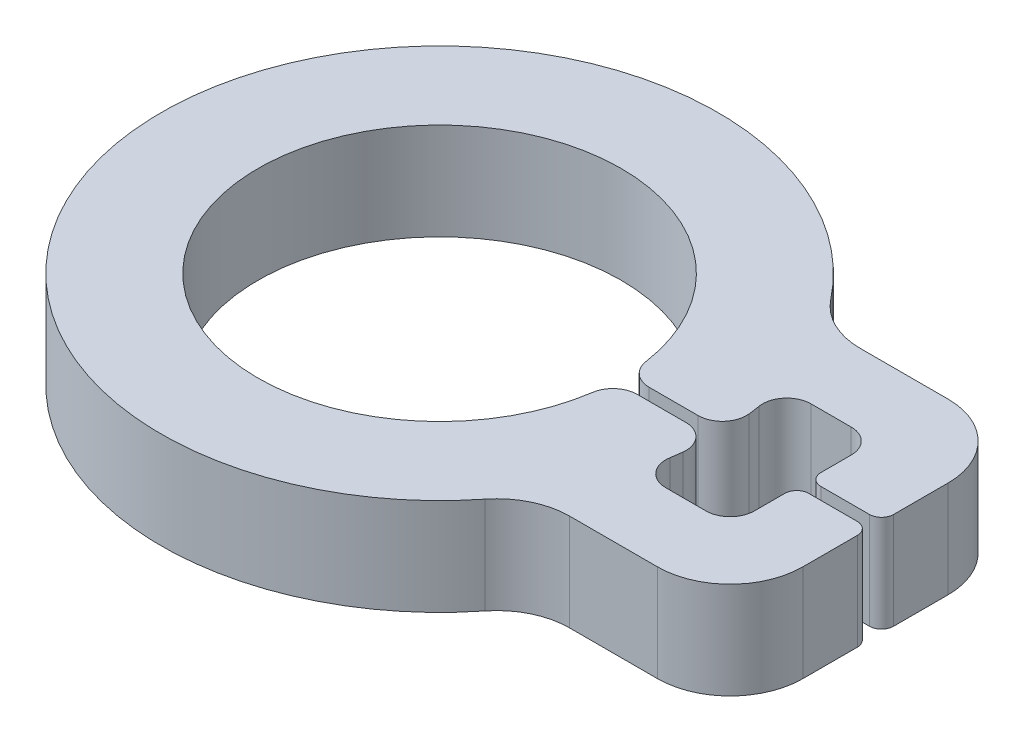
ISO-10303-21;
HEADER;
FILE_DESCRIPTION(('STEP AP214'),'2;1');
FILE_NAME('part.step','',(''),(''),'','','');
FILE_SCHEMA(('AUTOMOTIVE_DESIGN { 1 0 10303 214 1 1 1 1 }'));
ENDSEC;
DATA;
#1=APPLICATION_CONTEXT('core data for automotive mechanical design processes');
#2=APPLICATION_PROTOCOL_DEFINITION('international standard','automotive_design',2000,#1);
#3=PRODUCT_CONTEXT('',#1,'mechanical');
#4=PRODUCT('Part','Part','',(#3));
#5=PRODUCT_RELATED_PRODUCT_CATEGORY('part','',(#4));
#6=PRODUCT_DEFINITION_FORMATION('','',#4);
#7=PRODUCT_DEFINITION_CONTEXT('part definition',#1,'design');
#8=PRODUCT_DEFINITION('design','',#6,#7);
#9=PRODUCT_DEFINITION_SHAPE('','',#8);
#10=(LENGTH_UNIT() NAMED_UNIT(*) SI_UNIT(.MILLI.,.METRE.));
#11=(NAMED_UNIT(*) PLANE_ANGLE_UNIT() SI_UNIT($,.RADIAN.));
#12=(NAMED_UNIT(*) SI_UNIT($,.STERADIAN.) SOLID_ANGLE_UNIT());
#13=UNCERTAINTY_MEASURE_WITH_UNIT(LENGTH_MEASURE(1.E-05),#10,'distance_accuracy_value','');
#14=(GEOMETRIC_REPRESENTATION_CONTEXT(3) GLOBAL_UNCERTAINTY_ASSIGNED_CONTEXT((#13)) GLOBAL_UNIT_ASSIGNED_CONTEXT((#10,
#11,#12)) REPRESENTATION_CONTEXT('',''));
#15=CARTESIAN_POINT('',(0.,0.,0.));
#16=DIRECTION('',(0.,0.,1.));
#17=DIRECTION('',(1.,0.,0.));
#18=AXIS2_PLACEMENT_3D('',#15,#16,#17);
#19=CARTESIAN_POINT('',(0.,4.,0.));
#20=DIRECTION('',(0.,-1.,0.));
#21=DIRECTION('',(0.,0.,-1.));
#22=AXIS2_PLACEMENT_3D('',#19,#20,#21);
#23=CYLINDRICAL_SURFACE('',#22,11.5);
#24=CARTESIAN_POINT('',(0.,0.,0.));
#25=DIRECTION('',(0.,1.,0.));
#26=DIRECTION('',(0.,0.,1.));
#27=AXIS2_PLACEMENT_3D('',#24,#25,#26);
#28=CIRCLE('',#27,11.5);
#29=CARTESIAN_POINT('',(9.01664796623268,0.,-7.13793103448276));
#30=VERTEX_POINT('',#29);
#31=CARTESIAN_POINT('',(9.01664796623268,0.,7.13793103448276));
#32=VERTEX_POINT('',#31);
#33=EDGE_CURVE('E435',#30,#32,#28,.T.);
#34=ORIENTED_EDGE('',*,*,#33,.T.);
#35=DIRECTION('',(0.,-1.,0.));
#36=VECTOR('',#35,1.);
#37=CARTESIAN_POINT('',(9.01664796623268,4.,7.13793103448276));
#38=LINE('',#37,#36);
#39=CARTESIAN_POINT('',(9.01664796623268,4.,7.13793103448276));
#40=VERTEX_POINT('',#39);
#41=EDGE_CURVE('E412',#32,#40,#38,.F.);
#42=ORIENTED_EDGE('',*,*,#41,.T.);
#43=CARTESIAN_POINT('',(0.,4.,0.));
#44=DIRECTION('',(0.,1.,0.));
#45=DIRECTION('',(0.,0.,1.));
#46=AXIS2_PLACEMENT_3D('',#43,#44,#45);
#47=CIRCLE('',#46,11.5);
#48=CARTESIAN_POINT('',(9.01664796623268,4.,-7.13793103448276));
#49=VERTEX_POINT('',#48);
#50=EDGE_CURVE('E298',#49,#40,#47,.T.);
#51=ORIENTED_EDGE('',*,*,#50,.F.);
#52=DIRECTION('',(0.,-1.,0.));
#53=VECTOR('',#52,1.);
#54=CARTESIAN_POINT('',(9.01664796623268,4.,-7.13793103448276));
#55=LINE('',#54,#53);
#56=EDGE_CURVE('E409',#49,#30,#55,.T.);
#57=ORIENTED_EDGE('',*,*,#56,.T.);
#58=EDGE_LOOP('',(#34,#42,#51,#57));
#59=FACE_BOUND('',#58,.T.);
#60=ADVANCED_FACE('F36',(#59),#23,.T.);
#61=CARTESIAN_POINT('',(9.81070843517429,4.,6.));
#62=DIRECTION('',(0.,0.,-1.));
#63=DIRECTION('',(-1.,0.,0.));
#64=AXIS2_PLACEMENT_3D('',#61,#62,#63);
#65=PLANE('',#64);
#66=DIRECTION('',(1.,0.,0.));
#67=VECTOR('',#66,1.);
#68=CARTESIAN_POINT('',(9.81070843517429,4.,6.));
#69=LINE('',#68,#67);
#70=CARTESIAN_POINT('',(11.3688170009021,4.,6.));
#71=VERTEX_POINT('',#70);
#72=CARTESIAN_POINT('',(15.,4.,6.));
#73=VERTEX_POINT('',#72);
#74=EDGE_CURVE('E455',#71,#73,#69,.T.);
#75=ORIENTED_EDGE('',*,*,#74,.F.);
#76=DIRECTION('',(0.,1.,0.));
#77=VECTOR('',#76,1.);
#78=CARTESIAN_POINT('',(11.3688170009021,0.,6.));
#79=LINE('',#78,#77);
#80=CARTESIAN_POINT('',(11.3688170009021,0.,6.));
#81=VERTEX_POINT('',#80);
#82=EDGE_CURVE('E406',#71,#81,#79,.F.);
#83=ORIENTED_EDGE('',*,*,#82,.T.);
#84=DIRECTION('',(1.,0.,0.));
#85=VECTOR('',#84,1.);
#86=CARTESIAN_POINT('',(9.81070843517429,0.,6.));
#87=LINE('',#86,#85);
#88=CARTESIAN_POINT('',(15.,0.,6.));
#89=VERTEX_POINT('',#88);
#90=EDGE_CURVE('E494',#81,#89,#87,.T.);
#91=ORIENTED_EDGE('',*,*,#90,.T.);
#92=DIRECTION('',(0.,-1.,0.));
#93=VECTOR('',#92,1.);
#94=CARTESIAN_POINT('',(15.,4.,6.));
#95=LINE('',#94,#93);
#96=EDGE_CURVE('E404',#89,#73,#95,.F.);
#97=ORIENTED_EDGE('',*,*,#96,.T.);
#98=EDGE_LOOP('',(#75,#83,#91,#97));
#99=FACE_BOUND('',#98,.T.);
#100=ADVANCED_FACE('F530',(#99),#65,.F.);
#101=CARTESIAN_POINT('',(18.,4.,6.));
#102=DIRECTION('',(-1.,0.,0.));
#103=DIRECTION('',(0.,0.,1.));
#104=AXIS2_PLACEMENT_3D('',#101,#102,#103);
#105=PLANE('',#104);
#106=DIRECTION('',(0.,0.,-1.));
#107=VECTOR('',#106,1.);
#108=CARTESIAN_POINT('',(18.,4.,6.));
#109=LINE('',#108,#107);
#110=CARTESIAN_POINT('',(18.,4.,3.));
#111=VERTEX_POINT('',#110);
#112=CARTESIAN_POINT('',(18.,4.,0.75));
#113=VERTEX_POINT('',#112);
#114=EDGE_CURVE('E457',#111,#113,#109,.T.);
#115=ORIENTED_EDGE('',*,*,#114,.F.);
#116=DIRECTION('',(0.,-1.,0.));
#117=VECTOR('',#116,1.);
#118=CARTESIAN_POINT('',(18.,4.,3.));
#119=LINE('',#118,#117);
#120=CARTESIAN_POINT('',(18.,0.,3.));
#121=VERTEX_POINT('',#120);
#122=EDGE_CURVE('E419',#111,#121,#119,.T.);
#123=ORIENTED_EDGE('',*,*,#122,.T.);
#124=DIRECTION('',(0.,0.,-1.));
#125=VECTOR('',#124,1.);
#126=CARTESIAN_POINT('',(18.,0.,6.));
#127=LINE('',#126,#125);
#128=CARTESIAN_POINT('',(18.,0.,0.75));
#129=VERTEX_POINT('',#128);
#130=EDGE_CURVE('E497',#121,#129,#127,.T.);
#131=ORIENTED_EDGE('',*,*,#130,.T.);
#132=DIRECTION('',(0.,-1.,0.));
#133=VECTOR('',#132,1.);
#134=CARTESIAN_POINT('',(18.,4.,0.75));
#135=LINE('',#134,#133);
#136=EDGE_CURVE('E380',#129,#113,#135,.F.);
#137=ORIENTED_EDGE('',*,*,#136,.T.);
#138=EDGE_LOOP('',(#115,#123,#131,#137));
#139=FACE_BOUND('',#138,.T.);
#140=ADVANCED_FACE('F535',(#139),#105,.F.);
#141=CARTESIAN_POINT('',(18.,4.,0.25));
#142=DIRECTION('',(0.,0.,1.));
#143=DIRECTION('',(1.,0.,0.));
#144=AXIS2_PLACEMENT_3D('',#141,#142,#143);
#145=PLANE('',#144);
#146=DIRECTION('',(-1.,0.,0.));
#147=VECTOR('',#146,1.);
#148=CARTESIAN_POINT('',(18.,4.,0.25));
#149=LINE('',#148,#147);
#150=CARTESIAN_POINT('',(17.5,4.,0.25));
#151=VERTEX_POINT('',#150);
#152=CARTESIAN_POINT('',(15.5,4.,0.25));
#153=VERTEX_POINT('',#152);
#154=EDGE_CURVE('E461',#151,#153,#149,.T.);
#155=ORIENTED_EDGE('',*,*,#154,.F.);
#156=DIRECTION('',(0.,-1.,0.));
#157=VECTOR('',#156,1.);
#158=CARTESIAN_POINT('',(17.5,4.,0.25));
#159=LINE('',#158,#157);
#160=CARTESIAN_POINT('',(17.5,0.,0.25));
#161=VERTEX_POINT('',#160);
#162=EDGE_CURVE('E368',#151,#161,#159,.T.);
#163=ORIENTED_EDGE('',*,*,#162,.T.);
#164=DIRECTION('',(-1.,0.,0.));
#165=VECTOR('',#164,1.);
#166=CARTESIAN_POINT('',(18.,0.,0.25));
#167=LINE('',#166,#165);
#168=CARTESIAN_POINT('',(15.5,0.,0.25));
#169=VERTEX_POINT('',#168);
#170=EDGE_CURVE('E499',#161,#169,#167,.T.);
#171=ORIENTED_EDGE('',*,*,#170,.T.);
#172=DIRECTION('',(0.,-1.,0.));
#173=VECTOR('',#172,1.);
#174=CARTESIAN_POINT('',(15.5,4.,0.25));
#175=LINE('',#174,#173);
#176=EDGE_CURVE('E366',#169,#153,#175,.F.);
#177=ORIENTED_EDGE('',*,*,#176,.T.);
#178=EDGE_LOOP('',(#155,#163,#171,#177));
#179=FACE_BOUND('',#178,.T.);
#180=ADVANCED_FACE('F608',(#179),#145,.F.);
#181=CARTESIAN_POINT('',(15.,4.,0.25));
#182=DIRECTION('',(1.,0.,0.));
#183=DIRECTION('',(0.,0.,-1.));
#184=AXIS2_PLACEMENT_3D('',#181,#182,#183);
#185=PLANE('',#184);
#186=DIRECTION('',(0.,0.,1.));
#187=VECTOR('',#186,1.);
#188=CARTESIAN_POINT('',(15.,4.,0.25));
#189=LINE('',#188,#187);
#190=CARTESIAN_POINT('',(15.,4.,0.75));
#191=VERTEX_POINT('',#190);
#192=CARTESIAN_POINT('',(15.,4.,2.));
#193=VERTEX_POINT('',#192);
#194=EDGE_CURVE('E464',#191,#193,#189,.T.);
#195=ORIENTED_EDGE('',*,*,#194,.F.);
#196=DIRECTION('',(0.,-1.,0.));
#197=VECTOR('',#196,1.);
#198=CARTESIAN_POINT('',(15.,4.,0.75));
#199=LINE('',#198,#197);
#200=CARTESIAN_POINT('',(15.,0.,0.75));
#201=VERTEX_POINT('',#200);
#202=EDGE_CURVE('E399',#191,#201,#199,.T.);
#203=ORIENTED_EDGE('',*,*,#202,.T.);
#204=DIRECTION('',(0.,0.,1.));
#205=VECTOR('',#204,1.);
#206=CARTESIAN_POINT('',(15.,0.,0.25));
#207=LINE('',#206,#205);
#208=CARTESIAN_POINT('',(15.,0.,2.));
#209=VERTEX_POINT('',#208);
#210=EDGE_CURVE('E502',#201,#209,#207,.T.);
#211=ORIENTED_EDGE('',*,*,#210,.T.);
#212=DIRECTION('',(0.,-1.,0.));
#213=VECTOR('',#212,1.);
#214=CARTESIAN_POINT('',(15.,4.,2.));
#215=LINE('',#214,#213);
#216=EDGE_CURVE('E336',#209,#193,#215,.F.);
#217=ORIENTED_EDGE('',*,*,#216,.T.);
#218=EDGE_LOOP('',(#195,#203,#211,#217));
#219=FACE_BOUND('',#218,.T.);
#220=ADVANCED_FACE('F614',(#219),#185,.F.);
#221=CARTESIAN_POINT('',(15.,4.,3.));
#222=DIRECTION('',(0.,0.,1.));
#223=DIRECTION('',(1.,0.,0.));
#224=AXIS2_PLACEMENT_3D('',#221,#222,#223);
#225=PLANE('',#224);
#226=DIRECTION('',(-1.,0.,0.));
#227=VECTOR('',#226,1.);
#228=CARTESIAN_POINT('',(15.,0.,3.));
#229=LINE('',#228,#227);
#230=CARTESIAN_POINT('',(14.,0.,3.));
#231=VERTEX_POINT('',#230);
#232=CARTESIAN_POINT('',(12.3389626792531,0.,3.));
#233=VERTEX_POINT('',#232);
#234=EDGE_CURVE('E504',#231,#233,#229,.T.);
#235=ORIENTED_EDGE('',*,*,#234,.T.);
#236=DIRECTION('',(0.,1.,0.));
#237=VECTOR('',#236,1.);
#238=CARTESIAN_POINT('',(12.3389626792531,4.,3.));
#239=LINE('',#238,#237);
#240=CARTESIAN_POINT('',(12.3389626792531,4.,3.));
#241=VERTEX_POINT('',#240);
#242=EDGE_CURVE('E334',#233,#241,#239,.T.);
#243=ORIENTED_EDGE('',*,*,#242,.T.);
#244=DIRECTION('',(-1.,0.,0.));
#245=VECTOR('',#244,1.);
#246=CARTESIAN_POINT('',(15.,4.,3.));
#247=LINE('',#246,#245);
#248=CARTESIAN_POINT('',(14.,4.,3.));
#249=VERTEX_POINT('',#248);
#250=EDGE_CURVE('E466',#249,#241,#247,.T.);
#251=ORIENTED_EDGE('',*,*,#250,.F.);
#252=DIRECTION('',(0.,-1.,0.));
#253=VECTOR('',#252,1.);
#254=CARTESIAN_POINT('',(14.,0.,3.));
#255=LINE('',#254,#253);
#256=EDGE_CURVE('E331',#249,#231,#255,.T.);
#257=ORIENTED_EDGE('',*,*,#256,.T.);
#258=EDGE_LOOP('',(#235,#243,#251,#257));
#259=FACE_BOUND('',#258,.T.);
#260=ADVANCED_FACE('F527',(#259),#225,.F.);
#261=CARTESIAN_POINT('',(0.,4.,0.));
#262=DIRECTION('',(0.,-1.,0.));
#263=DIRECTION('',(0.,0.,-1.));
#264=AXIS2_PLACEMENT_3D('',#261,#262,#263);
#265=CYLINDRICAL_SURFACE('',#264,11.5);
#266=CARTESIAN_POINT('',(0.,4.,0.));
#267=DIRECTION('',(0.,1.,0.));
#268=DIRECTION('',(0.,0.,1.));
#269=AXIS2_PLACEMENT_3D('',#266,#267,#268);
#270=CIRCLE('',#269,11.5);
#271=CARTESIAN_POINT('',(11.3518456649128,4.,1.84));
#272=VERTEX_POINT('',#271);
#273=CARTESIAN_POINT('',(11.4182182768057,4.,1.36904761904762));
#274=VERTEX_POINT('',#273);
#275=EDGE_CURVE('E469',#272,#274,#270,.T.);
#276=ORIENTED_EDGE('',*,*,#275,.F.);
#277=DIRECTION('',(0.,-1.,0.));
#278=VECTOR('',#277,1.);
#279=CARTESIAN_POINT('',(11.3518456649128,4.,1.84));
#280=LINE('',#279,#278);
#281=CARTESIAN_POINT('',(11.3518456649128,0.,1.84));
#282=VERTEX_POINT('',#281);
#283=EDGE_CURVE('E328',#272,#282,#280,.T.);
#284=ORIENTED_EDGE('',*,*,#283,.T.);
#285=CARTESIAN_POINT('',(0.,0.,0.));
#286=DIRECTION('',(0.,1.,0.));
#287=DIRECTION('',(0.,0.,1.));
#288=AXIS2_PLACEMENT_3D('',#285,#286,#287);
#289=CIRCLE('',#288,11.5);
#290=CARTESIAN_POINT('',(11.4182182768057,0.,1.36904761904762));
#291=VERTEX_POINT('',#290);
#292=EDGE_CURVE('E278',#282,#291,#289,.T.);
#293=ORIENTED_EDGE('',*,*,#292,.T.);
#294=DIRECTION('',(0.,-1.,0.));
#295=VECTOR('',#294,1.);
#296=CARTESIAN_POINT('',(11.4182182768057,4.,1.36904761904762));
#297=LINE('',#296,#295);
#298=EDGE_CURVE('E322',#291,#274,#297,.F.);
#299=ORIENTED_EDGE('',*,*,#298,.T.);
#300=EDGE_LOOP('',(#276,#284,#293,#299));
#301=FACE_BOUND('',#300,.T.);
#302=ADVANCED_FACE('F509',(#301),#265,.T.);
#303=CARTESIAN_POINT('',(7.49583217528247,4.,0.25));
#304=DIRECTION('',(0.,0.,1.));
#305=DIRECTION('',(1.,0.,0.));
#306=AXIS2_PLACEMENT_3D('',#303,#304,#305);
#307=PLANE('',#306);
#308=DIRECTION('',(-1.,0.,0.));
#309=VECTOR('',#308,1.);
#310=CARTESIAN_POINT('',(7.49583217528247,0.,0.25));
#311=LINE('',#310,#309);
#312=CARTESIAN_POINT('',(10.4253297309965,0.,0.25));
#313=VERTEX_POINT('',#312);
#314=CARTESIAN_POINT('',(8.40758586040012,0.,0.25));
#315=VERTEX_POINT('',#314);
#316=EDGE_CURVE('E273',#313,#315,#311,.T.);
#317=ORIENTED_EDGE('',*,*,#316,.T.);
#318=DIRECTION('',(0.,-1.,0.));
#319=VECTOR('',#318,1.);
#320=CARTESIAN_POINT('',(8.40758586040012,4.,0.25));
#321=LINE('',#320,#319);
#322=CARTESIAN_POINT('',(8.40758586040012,4.,0.25));
#323=VERTEX_POINT('',#322);
#324=EDGE_CURVE('E251',#315,#323,#321,.F.);
#325=ORIENTED_EDGE('',*,*,#324,.T.);
#326=DIRECTION('',(-1.,0.,0.));
#327=VECTOR('',#326,1.);
#328=CARTESIAN_POINT('',(7.49583217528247,4.,0.25));
#329=LINE('',#328,#327);
#330=CARTESIAN_POINT('',(10.4253297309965,4.,0.25));
#331=VERTEX_POINT('',#330);
#332=EDGE_CURVE('E471',#331,#323,#329,.T.);
#333=ORIENTED_EDGE('',*,*,#332,.F.);
#334=DIRECTION('',(0.,-1.,0.));
#335=VECTOR('',#334,1.);
#336=CARTESIAN_POINT('',(10.4253297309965,4.,0.25));
#337=LINE('',#336,#335);
#338=EDGE_CURVE('E255',#331,#313,#337,.T.);
#339=ORIENTED_EDGE('',*,*,#338,.T.);
#340=EDGE_LOOP('',(#317,#325,#333,#339));
#341=FACE_BOUND('',#340,.T.);
#342=ADVANCED_FACE('F518',(#341),#307,.F.);
#343=CARTESIAN_POINT('',(0.,4.,0.));
#344=DIRECTION('',(0.,-1.,0.));
#345=DIRECTION('',(0.,0.,-1.));
#346=AXIS2_PLACEMENT_3D('',#343,#344,#345);
#347=CYLINDRICAL_SURFACE('',#346,7.5);
#348=CARTESIAN_POINT('',(0.,4.,0.));
#349=DIRECTION('',(0.,-1.,0.));
#350=DIRECTION('',(0.,0.,1.));
#351=AXIS2_PLACEMENT_3D('',#348,#349,#350);
#352=CIRCLE('',#351,7.5);
#353=CARTESIAN_POINT('',(7.41845811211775,4.,1.10294117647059));
#354=VERTEX_POINT('',#353);
#355=CARTESIAN_POINT('',(7.41845811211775,4.,-1.10294117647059));
#356=VERTEX_POINT('',#355);
#357=EDGE_CURVE('E265',#354,#356,#352,.T.);
#358=ORIENTED_EDGE('',*,*,#357,.F.);
#359=DIRECTION('',(0.,-1.,0.));
#360=VECTOR('',#359,1.);
#361=CARTESIAN_POINT('',(7.41845811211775,4.,1.10294117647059));
#362=LINE('',#361,#360);
#363=CARTESIAN_POINT('',(7.41845811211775,0.,1.10294117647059));
#364=VERTEX_POINT('',#363);
#365=EDGE_CURVE('E250',#354,#364,#362,.T.);
#366=ORIENTED_EDGE('',*,*,#365,.T.);
#367=CARTESIAN_POINT('',(0.,0.,0.));
#368=DIRECTION('',(0.,-1.,0.));
#369=DIRECTION('',(0.,0.,1.));
#370=AXIS2_PLACEMENT_3D('',#367,#368,#369);
#371=CIRCLE('',#370,7.5);
#372=CARTESIAN_POINT('',(7.41845811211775,0.,-1.10294117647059));
#373=VERTEX_POINT('',#372);
#374=EDGE_CURVE('E262',#364,#373,#371,.T.);
#375=ORIENTED_EDGE('',*,*,#374,.T.);
#376=DIRECTION('',(0.,-1.,0.));
#377=VECTOR('',#376,1.);
#378=CARTESIAN_POINT('',(7.41845811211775,4.,-1.10294117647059));
#379=LINE('',#378,#377);
#380=EDGE_CURVE('E267',#373,#356,#379,.F.);
#381=ORIENTED_EDGE('',*,*,#380,.T.);
#382=EDGE_LOOP('',(#358,#366,#375,#381));
#383=FACE_BOUND('',#382,.T.);
#384=ADVANCED_FACE('F261',(#383),#347,.F.);
#385=CARTESIAN_POINT('',(7.49583217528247,4.,-0.25));
#386=DIRECTION('',(0.,0.,-1.));
#387=DIRECTION('',(-1.,0.,0.));
#388=AXIS2_PLACEMENT_3D('',#385,#386,#387);
#389=PLANE('',#388);
#390=DIRECTION('',(1.,0.,0.));
#391=VECTOR('',#390,1.);
#392=CARTESIAN_POINT('',(7.49583217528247,4.,-0.25));
#393=LINE('',#392,#391);
#394=CARTESIAN_POINT('',(8.40758586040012,4.,-0.25));
#395=VERTEX_POINT('',#394);
#396=CARTESIAN_POINT('',(10.4253297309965,4.,-0.25));
#397=VERTEX_POINT('',#396);
#398=EDGE_CURVE('E475',#395,#397,#393,.T.);
#399=ORIENTED_EDGE('',*,*,#398,.F.);
#400=DIRECTION('',(0.,-1.,0.));
#401=VECTOR('',#400,1.);
#402=CARTESIAN_POINT('',(8.40758586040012,4.,-0.25));
#403=LINE('',#402,#401);
#404=CARTESIAN_POINT('',(8.40758586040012,0.,-0.25));
#405=VERTEX_POINT('',#404);
#406=EDGE_CURVE('E319',#395,#405,#403,.T.);
#407=ORIENTED_EDGE('',*,*,#406,.T.);
#408=DIRECTION('',(1.,0.,0.));
#409=VECTOR('',#408,1.);
#410=CARTESIAN_POINT('',(7.49583217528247,0.,-0.25));
#411=LINE('',#410,#409);
#412=CARTESIAN_POINT('',(10.4253297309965,0.,-0.25));
#413=VERTEX_POINT('',#412);
#414=EDGE_CURVE('E272',#405,#413,#411,.T.);
#415=ORIENTED_EDGE('',*,*,#414,.T.);
#416=DIRECTION('',(0.,-1.,0.));
#417=VECTOR('',#416,1.);
#418=CARTESIAN_POINT('',(10.4253297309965,4.,-0.25));
#419=LINE('',#418,#417);
#420=EDGE_CURVE('E317',#413,#397,#419,.F.);
#421=ORIENTED_EDGE('',*,*,#420,.T.);
#422=EDGE_LOOP('',(#399,#407,#415,#421));
#423=FACE_BOUND('',#422,.T.);
#424=ADVANCED_FACE('F525',(#423),#389,.F.);
#425=CARTESIAN_POINT('',(0.,4.,0.));
#426=DIRECTION('',(0.,-1.,0.));
#427=DIRECTION('',(0.,0.,-1.));
#428=AXIS2_PLACEMENT_3D('',#425,#426,#427);
#429=CYLINDRICAL_SURFACE('',#428,11.5);
#430=CARTESIAN_POINT('',(0.,0.,0.));
#431=DIRECTION('',(0.,1.,0.));
#432=DIRECTION('',(0.,0.,1.));
#433=AXIS2_PLACEMENT_3D('',#430,#431,#432);
#434=CIRCLE('',#433,11.5);
#435=CARTESIAN_POINT('',(11.4182182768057,0.,-1.36904761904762));
#436=VERTEX_POINT('',#435);
#437=CARTESIAN_POINT('',(11.3518456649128,0.,-1.84));
#438=VERTEX_POINT('',#437);
#439=EDGE_CURVE('E276',#436,#438,#434,.T.);
#440=ORIENTED_EDGE('',*,*,#439,.T.);
#441=DIRECTION('',(0.,-1.,0.));
#442=VECTOR('',#441,1.);
#443=CARTESIAN_POINT('',(11.3518456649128,4.,-1.84));
#444=LINE('',#443,#442);
#445=CARTESIAN_POINT('',(11.3518456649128,4.,-1.84));
#446=VERTEX_POINT('',#445);
#447=EDGE_CURVE('E347',#438,#446,#444,.F.);
#448=ORIENTED_EDGE('',*,*,#447,.T.);
#449=CARTESIAN_POINT('',(0.,4.,0.));
#450=DIRECTION('',(0.,1.,0.));
#451=DIRECTION('',(0.,0.,1.));
#452=AXIS2_PLACEMENT_3D('',#449,#450,#451);
#453=CIRCLE('',#452,11.5);
#454=CARTESIAN_POINT('',(11.4182182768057,4.,-1.36904761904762));
#455=VERTEX_POINT('',#454);
#456=EDGE_CURVE('E478',#455,#446,#453,.T.);
#457=ORIENTED_EDGE('',*,*,#456,.F.);
#458=DIRECTION('',(0.,-1.,0.));
#459=VECTOR('',#458,1.);
#460=CARTESIAN_POINT('',(11.4182182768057,4.,-1.36904761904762));
#461=LINE('',#460,#459);
#462=EDGE_CURVE('E325',#455,#436,#461,.T.);
#463=ORIENTED_EDGE('',*,*,#462,.T.);
#464=EDGE_LOOP('',(#440,#448,#457,#463));
#465=FACE_BOUND('',#464,.T.);
#466=ADVANCED_FACE('F806',(#465),#429,.T.);
#467=CARTESIAN_POINT('',(15.,4.,-3.));
#468=DIRECTION('',(0.,0.,-1.));
#469=DIRECTION('',(-1.,0.,0.));
#470=AXIS2_PLACEMENT_3D('',#467,#468,#469);
#471=PLANE('',#470);
#472=DIRECTION('',(1.,0.,0.));
#473=VECTOR('',#472,1.);
#474=CARTESIAN_POINT('',(15.,0.,-3.));
#475=LINE('',#474,#473);
#476=CARTESIAN_POINT('',(12.3389626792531,0.,-3.));
#477=VERTEX_POINT('',#476);
#478=CARTESIAN_POINT('',(14.,0.,-3.));
#479=VERTEX_POINT('',#478);
#480=EDGE_CURVE('E284',#477,#479,#475,.T.);
#481=ORIENTED_EDGE('',*,*,#480,.T.);
#482=DIRECTION('',(0.,-1.,0.));
#483=VECTOR('',#482,1.);
#484=CARTESIAN_POINT('',(14.,4.,-3.));
#485=LINE('',#484,#483);
#486=CARTESIAN_POINT('',(14.,4.,-3.));
#487=VERTEX_POINT('',#486);
#488=EDGE_CURVE('E345',#479,#487,#485,.F.);
#489=ORIENTED_EDGE('',*,*,#488,.T.);
#490=DIRECTION('',(1.,0.,0.));
#491=VECTOR('',#490,1.);
#492=CARTESIAN_POINT('',(15.,4.,-3.));
#493=LINE('',#492,#491);
#494=CARTESIAN_POINT('',(12.3389626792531,4.,-3.));
#495=VERTEX_POINT('',#494);
#496=EDGE_CURVE('E481',#495,#487,#493,.T.);
#497=ORIENTED_EDGE('',*,*,#496,.F.);
#498=DIRECTION('',(0.,1.,0.));
#499=VECTOR('',#498,1.);
#500=CARTESIAN_POINT('',(12.3389626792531,0.,-3.));
#501=LINE('',#500,#499);
#502=EDGE_CURVE('E342',#495,#477,#501,.F.);
#503=ORIENTED_EDGE('',*,*,#502,.T.);
#504=EDGE_LOOP('',(#481,#489,#497,#503));
#505=FACE_BOUND('',#504,.T.);
#506=ADVANCED_FACE('F661',(#505),#471,.F.);
#507=CARTESIAN_POINT('',(15.,4.,-0.25));
#508=DIRECTION('',(1.,0.,0.));
#509=DIRECTION('',(0.,0.,-1.));
#510=AXIS2_PLACEMENT_3D('',#507,#508,#509);
#511=PLANE('',#510);
#512=DIRECTION('',(0.,0.,1.));
#513=VECTOR('',#512,1.);
#514=CARTESIAN_POINT('',(15.,0.,-0.25));
#515=LINE('',#514,#513);
#516=CARTESIAN_POINT('',(15.,0.,-2.));
#517=VERTEX_POINT('',#516);
#518=CARTESIAN_POINT('',(15.,0.,-0.75));
#519=VERTEX_POINT('',#518);
#520=EDGE_CURVE('E287',#517,#519,#515,.T.);
#521=ORIENTED_EDGE('',*,*,#520,.T.);
#522=DIRECTION('',(0.,-1.,0.));
#523=VECTOR('',#522,1.);
#524=CARTESIAN_POINT('',(15.,4.,-0.75));
#525=LINE('',#524,#523);
#526=CARTESIAN_POINT('',(15.,4.,-0.75));
#527=VERTEX_POINT('',#526);
#528=EDGE_CURVE('E402',#519,#527,#525,.F.);
#529=ORIENTED_EDGE('',*,*,#528,.T.);
#530=DIRECTION('',(0.,0.,1.));
#531=VECTOR('',#530,1.);
#532=CARTESIAN_POINT('',(15.,4.,-0.25));
#533=LINE('',#532,#531);
#534=CARTESIAN_POINT('',(15.,4.,-2.));
#535=VERTEX_POINT('',#534);
#536=EDGE_CURVE('E484',#535,#527,#533,.T.);
#537=ORIENTED_EDGE('',*,*,#536,.F.);
#538=DIRECTION('',(0.,-1.,0.));
#539=VECTOR('',#538,1.);
#540=CARTESIAN_POINT('',(15.,0.,-2.));
#541=LINE('',#540,#539);
#542=EDGE_CURVE('E339',#535,#517,#541,.T.);
#543=ORIENTED_EDGE('',*,*,#542,.T.);
#544=EDGE_LOOP('',(#521,#529,#537,#543));
#545=FACE_BOUND('',#544,.T.);
#546=ADVANCED_FACE('F655',(#545),#511,.F.);
#547=CARTESIAN_POINT('',(18.,4.,-0.25));
#548=DIRECTION('',(0.,0.,-1.));
#549=DIRECTION('',(-1.,0.,0.));
#550=AXIS2_PLACEMENT_3D('',#547,#548,#549);
#551=PLANE('',#550);
#552=DIRECTION('',(1.,0.,0.));
#553=VECTOR('',#552,1.);
#554=CARTESIAN_POINT('',(18.,0.,-0.25));
#555=LINE('',#554,#553);
#556=CARTESIAN_POINT('',(15.5,0.,-0.25));
#557=VERTEX_POINT('',#556);
#558=CARTESIAN_POINT('',(17.5,0.,-0.25));
#559=VERTEX_POINT('',#558);
#560=EDGE_CURVE('E290',#557,#559,#555,.T.);
#561=ORIENTED_EDGE('',*,*,#560,.T.);
#562=DIRECTION('',(0.,-1.,0.));
#563=VECTOR('',#562,1.);
#564=CARTESIAN_POINT('',(17.5,4.,-0.25));
#565=LINE('',#564,#563);
#566=CARTESIAN_POINT('',(17.5,4.,-0.25));
#567=VERTEX_POINT('',#566);
#568=EDGE_CURVE('E397',#559,#567,#565,.F.);
#569=ORIENTED_EDGE('',*,*,#568,.T.);
#570=DIRECTION('',(1.,0.,0.));
#571=VECTOR('',#570,1.);
#572=CARTESIAN_POINT('',(18.,4.,-0.25));
#573=LINE('',#572,#571);
#574=CARTESIAN_POINT('',(15.5,4.,-0.25));
#575=VERTEX_POINT('',#574);
#576=EDGE_CURVE('E487',#575,#567,#573,.T.);
#577=ORIENTED_EDGE('',*,*,#576,.F.);
#578=DIRECTION('',(0.,-1.,0.));
#579=VECTOR('',#578,1.);
#580=CARTESIAN_POINT('',(15.5,4.,-0.25));
#581=LINE('',#580,#579);
#582=EDGE_CURVE('E394',#575,#557,#581,.T.);
#583=ORIENTED_EDGE('',*,*,#582,.T.);
#584=EDGE_LOOP('',(#561,#569,#577,#583));
#585=FACE_BOUND('',#584,.T.);
#586=ADVANCED_FACE('F660',(#585),#551,.F.);
#587=CARTESIAN_POINT('',(18.,4.,-6.));
#588=DIRECTION('',(-1.,0.,0.));
#589=DIRECTION('',(0.,0.,1.));
#590=AXIS2_PLACEMENT_3D('',#587,#588,#589);
#591=PLANE('',#590);
#592=DIRECTION('',(0.,0.,-1.));
#593=VECTOR('',#592,1.);
#594=CARTESIAN_POINT('',(18.,0.,-6.));
#595=LINE('',#594,#593);
#596=CARTESIAN_POINT('',(18.,0.,-0.750000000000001));
#597=VERTEX_POINT('',#596);
#598=CARTESIAN_POINT('',(18.,0.,-3.));
#599=VERTEX_POINT('',#598);
#600=EDGE_CURVE('E293',#597,#599,#595,.T.);
#601=ORIENTED_EDGE('',*,*,#600,.T.);
#602=DIRECTION('',(0.,-1.,0.));
#603=VECTOR('',#602,1.);
#604=CARTESIAN_POINT('',(18.,4.,-3.));
#605=LINE('',#604,#603);
#606=CARTESIAN_POINT('',(18.,4.,-3.));
#607=VERTEX_POINT('',#606);
#608=EDGE_CURVE('E51',#599,#607,#605,.F.);
#609=ORIENTED_EDGE('',*,*,#608,.T.);
#610=DIRECTION('',(0.,0.,-1.));
#611=VECTOR('',#610,1.);
#612=CARTESIAN_POINT('',(18.,4.,-6.));
#613=LINE('',#612,#611);
#614=CARTESIAN_POINT('',(18.,4.,-0.750000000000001));
#615=VERTEX_POINT('',#614);
#616=EDGE_CURVE('E490',#615,#607,#613,.T.);
#617=ORIENTED_EDGE('',*,*,#616,.F.);
#618=DIRECTION('',(0.,-1.,0.));
#619=VECTOR('',#618,1.);
#620=CARTESIAN_POINT('',(18.,4.,-0.750000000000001));
#621=LINE('',#620,#619);
#622=EDGE_CURVE('E391',#615,#597,#621,.T.);
#623=ORIENTED_EDGE('',*,*,#622,.T.);
#624=EDGE_LOOP('',(#601,#609,#617,#623));
#625=FACE_BOUND('',#624,.T.);
#626=ADVANCED_FACE('F673',(#625),#591,.F.);
#627=CARTESIAN_POINT('',(9.81070843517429,4.,-6.));
#628=DIRECTION('',(0.,0.,1.));
#629=DIRECTION('',(1.,0.,0.));
#630=AXIS2_PLACEMENT_3D('',#627,#628,#629);
#631=PLANE('',#630);
#632=DIRECTION('',(-1.,0.,0.));
#633=VECTOR('',#632,1.);
#634=CARTESIAN_POINT('',(9.81070843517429,0.,-6.));
#635=LINE('',#634,#633);
#636=CARTESIAN_POINT('',(15.,0.,-6.));
#637=VERTEX_POINT('',#636);
#638=CARTESIAN_POINT('',(11.3688170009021,0.,-6.));
#639=VERTEX_POINT('',#638);
#640=EDGE_CURVE('E295',#637,#639,#635,.T.);
#641=ORIENTED_EDGE('',*,*,#640,.T.);
#642=DIRECTION('',(0.,1.,0.));
#643=VECTOR('',#642,1.);
#644=CARTESIAN_POINT('',(11.3688170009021,4.,-6.));
#645=LINE('',#644,#643);
#646=CARTESIAN_POINT('',(11.3688170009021,4.,-6.));
#647=VERTEX_POINT('',#646);
#648=EDGE_CURVE('E417',#639,#647,#645,.T.);
#649=ORIENTED_EDGE('',*,*,#648,.T.);
#650=DIRECTION('',(-1.,0.,0.));
#651=VECTOR('',#650,1.);
#652=CARTESIAN_POINT('',(9.81070843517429,4.,-6.));
#653=LINE('',#652,#651);
#654=CARTESIAN_POINT('',(15.,4.,-6.));
#655=VERTEX_POINT('',#654);
#656=EDGE_CURVE('E299',#655,#647,#653,.T.);
#657=ORIENTED_EDGE('',*,*,#656,.F.);
#658=DIRECTION('',(0.,-1.,0.));
#659=VECTOR('',#658,1.);
#660=CARTESIAN_POINT('',(15.,4.,-6.));
#661=LINE('',#660,#659);
#662=EDGE_CURVE('E414',#655,#637,#661,.T.);
#663=ORIENTED_EDGE('',*,*,#662,.T.);
#664=EDGE_LOOP('',(#641,#649,#657,#663));
#665=FACE_BOUND('',#664,.T.);
#666=ADVANCED_FACE('F440',(#665),#631,.F.);
#667=CARTESIAN_POINT('',(0.,4.,0.));
#668=DIRECTION('',(0.,1.,0.));
#669=DIRECTION('',(0.,0.,1.));
#670=AXIS2_PLACEMENT_3D('',#667,#668,#669);
#671=PLANE('',#670);
#672=ORIENTED_EDGE('',*,*,#74,.T.);
#673=CARTESIAN_POINT('',(15.,4.,3.));
#674=DIRECTION('',(0.,1.,0.));
#675=DIRECTION('',(0.,0.,1.));
#676=AXIS2_PLACEMENT_3D('',#673,#674,#675);
#677=CIRCLE('',#676,3.);
#678=EDGE_CURVE('E427',#73,#111,#677,.T.);
#679=ORIENTED_EDGE('',*,*,#678,.T.);
#680=ORIENTED_EDGE('',*,*,#114,.T.);
#681=CARTESIAN_POINT('',(17.5,4.,0.75));
#682=DIRECTION('',(0.,1.,0.));
#683=DIRECTION('',(0.,0.,1.));
#684=AXIS2_PLACEMENT_3D('',#681,#682,#683);
#685=CIRCLE('',#684,0.5);
#686=EDGE_CURVE('E389',#113,#151,#685,.T.);
#687=ORIENTED_EDGE('',*,*,#686,.T.);
#688=ORIENTED_EDGE('',*,*,#154,.T.);
#689=CARTESIAN_POINT('',(15.5,4.,0.75));
#690=DIRECTION('',(0.,1.,0.));
#691=DIRECTION('',(0.,0.,1.));
#692=AXIS2_PLACEMENT_3D('',#689,#690,#691);
#693=CIRCLE('',#692,0.5);
#694=EDGE_CURVE('E385',#153,#191,#693,.T.);
#695=ORIENTED_EDGE('',*,*,#694,.T.);
#696=ORIENTED_EDGE('',*,*,#194,.T.);
#697=CARTESIAN_POINT('',(14.,4.,2.));
#698=DIRECTION('',(0.,1.,0.));
#699=DIRECTION('',(0.,0.,1.));
#700=AXIS2_PLACEMENT_3D('',#697,#698,#699);
#701=CIRCLE('',#700,1.);
#702=EDGE_CURVE('E356',#193,#249,#701,.F.);
#703=ORIENTED_EDGE('',*,*,#702,.T.);
#704=ORIENTED_EDGE('',*,*,#250,.T.);
#705=CARTESIAN_POINT('',(12.3389626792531,4.,2.));
#706=DIRECTION('',(0.,1.,0.));
#707=DIRECTION('',(0.,0.,1.));
#708=AXIS2_PLACEMENT_3D('',#705,#706,#707);
#709=CIRCLE('',#708,1.);
#710=EDGE_CURVE('E351',#241,#272,#709,.F.);
#711=ORIENTED_EDGE('',*,*,#710,.T.);
#712=ORIENTED_EDGE('',*,*,#275,.T.);
#713=CARTESIAN_POINT('',(10.4253297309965,4.,1.25));
#714=DIRECTION('',(0.,1.,0.));
#715=DIRECTION('',(0.,0.,1.));
#716=AXIS2_PLACEMENT_3D('',#713,#714,#715);
#717=CIRCLE('',#716,1.);
#718=EDGE_CURVE('E311',#274,#331,#717,.T.);
#719=ORIENTED_EDGE('',*,*,#718,.T.);
#720=ORIENTED_EDGE('',*,*,#332,.T.);
#721=CARTESIAN_POINT('',(8.40758586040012,4.,1.25));
#722=DIRECTION('',(0.,1.,0.));
#723=DIRECTION('',(0.,0.,1.));
#724=AXIS2_PLACEMENT_3D('',#721,#722,#723);
#725=CIRCLE('',#724,1.);
#726=EDGE_CURVE('E315',#323,#354,#725,.T.);
#727=ORIENTED_EDGE('',*,*,#726,.T.);
#728=ORIENTED_EDGE('',*,*,#357,.T.);
#729=CARTESIAN_POINT('',(8.40758586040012,4.,-1.25));
#730=DIRECTION('',(0.,1.,0.));
#731=DIRECTION('',(0.,0.,1.));
#732=AXIS2_PLACEMENT_3D('',#729,#730,#731);
#733=CIRCLE('',#732,1.);
#734=EDGE_CURVE('E313',#356,#395,#733,.T.);
#735=ORIENTED_EDGE('',*,*,#734,.T.);
#736=ORIENTED_EDGE('',*,*,#398,.T.);
#737=CARTESIAN_POINT('',(10.4253297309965,4.,-1.25));
#738=DIRECTION('',(0.,1.,0.));
#739=DIRECTION('',(0.,0.,1.));
#740=AXIS2_PLACEMENT_3D('',#737,#738,#739);
#741=CIRCLE('',#740,1.);
#742=EDGE_CURVE('E309',#397,#455,#741,.T.);
#743=ORIENTED_EDGE('',*,*,#742,.T.);
#744=ORIENTED_EDGE('',*,*,#456,.T.);
#745=CARTESIAN_POINT('',(12.3389626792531,4.,-2.));
#746=DIRECTION('',(0.,1.,0.));
#747=DIRECTION('',(0.,0.,1.));
#748=AXIS2_PLACEMENT_3D('',#745,#746,#747);
#749=CIRCLE('',#748,1.);
#750=EDGE_CURVE('E364',#446,#495,#749,.F.);
#751=ORIENTED_EDGE('',*,*,#750,.T.);
#752=ORIENTED_EDGE('',*,*,#496,.T.);
#753=CARTESIAN_POINT('',(14.,4.,-2.));
#754=DIRECTION('',(0.,1.,0.));
#755=DIRECTION('',(0.,0.,1.));
#756=AXIS2_PLACEMENT_3D('',#753,#754,#755);
#757=CIRCLE('',#756,1.);
#758=EDGE_CURVE('E360',#487,#535,#757,.F.);
#759=ORIENTED_EDGE('',*,*,#758,.T.);
#760=ORIENTED_EDGE('',*,*,#536,.T.);
#761=CARTESIAN_POINT('',(15.5,4.,-0.75));
#762=DIRECTION('',(0.,1.,0.));
#763=DIRECTION('',(0.,0.,1.));
#764=AXIS2_PLACEMENT_3D('',#761,#762,#763);
#765=CIRCLE('',#764,0.5);
#766=EDGE_CURVE('E383',#527,#575,#765,.T.);
#767=ORIENTED_EDGE('',*,*,#766,.T.);
#768=ORIENTED_EDGE('',*,*,#576,.T.);
#769=CARTESIAN_POINT('',(17.5,4.,-0.750000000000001));
#770=DIRECTION('',(0.,1.,0.));
#771=DIRECTION('',(0.,0.,1.));
#772=AXIS2_PLACEMENT_3D('',#769,#770,#771);
#773=CIRCLE('',#772,0.5);
#774=EDGE_CURVE('E387',#567,#615,#773,.T.);
#775=ORIENTED_EDGE('',*,*,#774,.T.);
#776=ORIENTED_EDGE('',*,*,#616,.T.);
#777=CARTESIAN_POINT('',(15.,4.,-3.));
#778=DIRECTION('',(0.,1.,0.));
#779=DIRECTION('',(0.,0.,1.));
#780=AXIS2_PLACEMENT_3D('',#777,#778,#779);
#781=CIRCLE('',#780,3.);
#782=EDGE_CURVE('E425',#607,#655,#781,.T.);
#783=ORIENTED_EDGE('',*,*,#782,.T.);
#784=ORIENTED_EDGE('',*,*,#656,.T.);
#785=CARTESIAN_POINT('',(11.3688170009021,4.,-9.));
#786=DIRECTION('',(0.,1.,0.));
#787=DIRECTION('',(0.,0.,1.));
#788=AXIS2_PLACEMENT_3D('',#785,#786,#787);
#789=CIRCLE('',#788,3.);
#790=EDGE_CURVE('E11',#647,#49,#789,.F.);
#791=ORIENTED_EDGE('',*,*,#790,.T.);
#792=ORIENTED_EDGE('',*,*,#50,.T.);
#793=CARTESIAN_POINT('',(11.3688170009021,4.,9.));
#794=DIRECTION('',(0.,1.,0.));
#795=DIRECTION('',(0.,0.,1.));
#796=AXIS2_PLACEMENT_3D('',#793,#794,#795);
#797=CIRCLE('',#796,3.);
#798=EDGE_CURVE('E432',#40,#71,#797,.F.);
#799=ORIENTED_EDGE('',*,*,#798,.T.);
#800=EDGE_LOOP('',(#672,#679,#680,#687,#688,#695,#696,#703,#704,#711,#712,#719,#720,#727,#728,
#735,#736,#743,#744,#751,#752,#759,#760,#767,#768,#775,#776,#783,#784,#791,#792,#799));
#801=FACE_BOUND('',#800,.T.);
#802=ADVANCED_FACE('F450',(#801),#671,.T.);
#803=CARTESIAN_POINT('',(0.,0.,0.));
#804=DIRECTION('',(0.,1.,0.));
#805=DIRECTION('',(0.,0.,1.));
#806=AXIS2_PLACEMENT_3D('',#803,#804,#805);
#807=PLANE('',#806);
#808=ORIENTED_EDGE('',*,*,#130,.F.);
#809=CARTESIAN_POINT('',(15.,0.,3.));
#810=DIRECTION('',(0.,1.,0.));
#811=DIRECTION('',(0.,0.,1.));
#812=AXIS2_PLACEMENT_3D('',#809,#810,#811);
#813=CIRCLE('',#812,3.);
#814=EDGE_CURVE('E423',#121,#89,#813,.F.);
#815=ORIENTED_EDGE('',*,*,#814,.T.);
#816=ORIENTED_EDGE('',*,*,#90,.F.);
#817=CARTESIAN_POINT('',(11.3688170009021,0.,9.));
#818=DIRECTION('',(0.,1.,0.));
#819=DIRECTION('',(0.,0.,1.));
#820=AXIS2_PLACEMENT_3D('',#817,#818,#819);
#821=CIRCLE('',#820,3.);
#822=EDGE_CURVE('E430',#81,#32,#821,.T.);
#823=ORIENTED_EDGE('',*,*,#822,.T.);
#824=ORIENTED_EDGE('',*,*,#33,.F.);
#825=CARTESIAN_POINT('',(11.3688170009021,0.,-9.));
#826=DIRECTION('',(0.,1.,0.));
#827=DIRECTION('',(0.,0.,1.));
#828=AXIS2_PLACEMENT_3D('',#825,#826,#827);
#829=CIRCLE('',#828,3.);
#830=EDGE_CURVE('E44',#30,#639,#829,.T.);
#831=ORIENTED_EDGE('',*,*,#830,.T.);
#832=ORIENTED_EDGE('',*,*,#640,.F.);
#833=CARTESIAN_POINT('',(15.,0.,-3.));
#834=DIRECTION('',(0.,1.,0.));
#835=DIRECTION('',(0.,0.,1.));
#836=AXIS2_PLACEMENT_3D('',#833,#834,#835);
#837=CIRCLE('',#836,3.);
#838=EDGE_CURVE('E59',#637,#599,#837,.F.);
#839=ORIENTED_EDGE('',*,*,#838,.T.);
#840=ORIENTED_EDGE('',*,*,#600,.F.);
#841=CARTESIAN_POINT('',(17.5,0.,-0.750000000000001));
#842=DIRECTION('',(0.,1.,0.));
#843=DIRECTION('',(0.,0.,1.));
#844=AXIS2_PLACEMENT_3D('',#841,#842,#843);
#845=CIRCLE('',#844,0.5);
#846=EDGE_CURVE('E375',#597,#559,#845,.F.);
#847=ORIENTED_EDGE('',*,*,#846,.T.);
#848=ORIENTED_EDGE('',*,*,#560,.F.);
#849=CARTESIAN_POINT('',(15.5,0.,-0.75));
#850=DIRECTION('',(0.,1.,0.));
#851=DIRECTION('',(0.,0.,1.));
#852=AXIS2_PLACEMENT_3D('',#849,#850,#851);
#853=CIRCLE('',#852,0.5);
#854=EDGE_CURVE('E371',#557,#519,#853,.F.);
#855=ORIENTED_EDGE('',*,*,#854,.T.);
#856=ORIENTED_EDGE('',*,*,#520,.F.);
#857=CARTESIAN_POINT('',(14.,0.,-2.));
#858=DIRECTION('',(0.,1.,0.));
#859=DIRECTION('',(0.,0.,1.));
#860=AXIS2_PLACEMENT_3D('',#857,#858,#859);
#861=CIRCLE('',#860,1.);
#862=EDGE_CURVE('E358',#517,#479,#861,.T.);
#863=ORIENTED_EDGE('',*,*,#862,.T.);
#864=ORIENTED_EDGE('',*,*,#480,.F.);
#865=CARTESIAN_POINT('',(12.3389626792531,0.,-2.));
#866=DIRECTION('',(0.,1.,0.));
#867=DIRECTION('',(0.,0.,1.));
#868=AXIS2_PLACEMENT_3D('',#865,#866,#867);
#869=CIRCLE('',#868,1.);
#870=EDGE_CURVE('E362',#477,#438,#869,.T.);
#871=ORIENTED_EDGE('',*,*,#870,.T.);
#872=ORIENTED_EDGE('',*,*,#439,.F.);
#873=CARTESIAN_POINT('',(10.4253297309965,0.,-1.25));
#874=DIRECTION('',(0.,1.,0.));
#875=DIRECTION('',(0.,0.,1.));
#876=AXIS2_PLACEMENT_3D('',#873,#874,#875);
#877=CIRCLE('',#876,1.);
#878=EDGE_CURVE('E266',#436,#413,#877,.F.);
#879=ORIENTED_EDGE('',*,*,#878,.T.);
#880=ORIENTED_EDGE('',*,*,#414,.F.);
#881=CARTESIAN_POINT('',(8.40758586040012,0.,-1.25));
#882=DIRECTION('',(0.,1.,0.));
#883=DIRECTION('',(0.,0.,1.));
#884=AXIS2_PLACEMENT_3D('',#881,#882,#883);
#885=CIRCLE('',#884,1.);
#886=EDGE_CURVE('E256',#405,#373,#885,.F.);
#887=ORIENTED_EDGE('',*,*,#886,.T.);
#888=ORIENTED_EDGE('',*,*,#374,.F.);
#889=CARTESIAN_POINT('',(8.40758586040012,0.,1.25));
#890=DIRECTION('',(0.,1.,0.));
#891=DIRECTION('',(0.,0.,1.));
#892=AXIS2_PLACEMENT_3D('',#889,#890,#891);
#893=CIRCLE('',#892,1.);
#894=EDGE_CURVE('E246',#364,#315,#893,.F.);
#895=ORIENTED_EDGE('',*,*,#894,.T.);
#896=ORIENTED_EDGE('',*,*,#316,.F.);
#897=CARTESIAN_POINT('',(10.4253297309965,0.,1.25));
#898=DIRECTION('',(0.,1.,0.));
#899=DIRECTION('',(0.,0.,1.));
#900=AXIS2_PLACEMENT_3D('',#897,#898,#899);
#901=CIRCLE('',#900,1.);
#902=EDGE_CURVE('E302',#313,#291,#901,.F.);
#903=ORIENTED_EDGE('',*,*,#902,.T.);
#904=ORIENTED_EDGE('',*,*,#292,.F.);
#905=CARTESIAN_POINT('',(12.3389626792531,0.,2.));
#906=DIRECTION('',(0.,1.,0.));
#907=DIRECTION('',(0.,0.,1.));
#908=AXIS2_PLACEMENT_3D('',#905,#906,#907);
#909=CIRCLE('',#908,1.);
#910=EDGE_CURVE('E349',#282,#233,#909,.T.);
#911=ORIENTED_EDGE('',*,*,#910,.T.);
#912=ORIENTED_EDGE('',*,*,#234,.F.);
#913=CARTESIAN_POINT('',(14.,0.,2.));
#914=DIRECTION('',(0.,1.,0.));
#915=DIRECTION('',(0.,0.,1.));
#916=AXIS2_PLACEMENT_3D('',#913,#914,#915);
#917=CIRCLE('',#916,1.);
#918=EDGE_CURVE('E353',#231,#209,#917,.T.);
#919=ORIENTED_EDGE('',*,*,#918,.T.);
#920=ORIENTED_EDGE('',*,*,#210,.F.);
#921=CARTESIAN_POINT('',(15.5,0.,0.75));
#922=DIRECTION('',(0.,1.,0.));
#923=DIRECTION('',(0.,0.,1.));
#924=AXIS2_PLACEMENT_3D('',#921,#922,#923);
#925=CIRCLE('',#924,0.5);
#926=EDGE_CURVE('E373',#201,#169,#925,.F.);
#927=ORIENTED_EDGE('',*,*,#926,.T.);
#928=ORIENTED_EDGE('',*,*,#170,.F.);
#929=CARTESIAN_POINT('',(17.5,0.,0.75));
#930=DIRECTION('',(0.,1.,0.));
#931=DIRECTION('',(0.,0.,1.));
#932=AXIS2_PLACEMENT_3D('',#929,#930,#931);
#933=CIRCLE('',#932,0.5);
#934=EDGE_CURVE('E377',#161,#129,#933,.F.);
#935=ORIENTED_EDGE('',*,*,#934,.T.);
#936=EDGE_LOOP('',(#808,#815,#816,#823,#824,#831,#832,#839,#840,#847,#848,#855,#856,#863,#864,
#871,#872,#879,#880,#887,#888,#895,#896,#903,#904,#911,#912,#919,#920,#927,#928,#935));
#937=FACE_BOUND('',#936,.T.);
#938=ADVANCED_FACE('F270',(#937),#807,.F.);
#939=CARTESIAN_POINT('',(8.40758586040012,4.,1.25));
#940=DIRECTION('',(0.,-1.,0.));
#941=DIRECTION('',(0.,0.,-1.));
#942=AXIS2_PLACEMENT_3D('',#939,#940,#941);
#943=CYLINDRICAL_SURFACE('',#942,1.);
#944=ORIENTED_EDGE('',*,*,#726,.F.);
#945=ORIENTED_EDGE('',*,*,#324,.F.);
#946=ORIENTED_EDGE('',*,*,#894,.F.);
#947=ORIENTED_EDGE('',*,*,#365,.F.);
#948=EDGE_LOOP('',(#944,#945,#946,#947));
#949=FACE_BOUND('',#948,.T.);
#950=ADVANCED_FACE('F249',(#949),#943,.T.);
#951=CARTESIAN_POINT('',(8.40758586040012,4.,-1.25));
#952=DIRECTION('',(0.,-1.,0.));
#953=DIRECTION('',(0.,0.,-1.));
#954=AXIS2_PLACEMENT_3D('',#951,#952,#953);
#955=CYLINDRICAL_SURFACE('',#954,1.);
#956=ORIENTED_EDGE('',*,*,#734,.F.);
#957=ORIENTED_EDGE('',*,*,#380,.F.);
#958=ORIENTED_EDGE('',*,*,#886,.F.);
#959=ORIENTED_EDGE('',*,*,#406,.F.);
#960=EDGE_LOOP('',(#956,#957,#958,#959));
#961=FACE_BOUND('',#960,.T.);
#962=ADVANCED_FACE('F542',(#961),#955,.T.);
#963=CARTESIAN_POINT('',(10.4253297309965,4.,1.25));
#964=DIRECTION('',(0.,-1.,0.));
#965=DIRECTION('',(0.,0.,-1.));
#966=AXIS2_PLACEMENT_3D('',#963,#964,#965);
#967=CYLINDRICAL_SURFACE('',#966,1.);
#968=ORIENTED_EDGE('',*,*,#718,.F.);
#969=ORIENTED_EDGE('',*,*,#298,.F.);
#970=ORIENTED_EDGE('',*,*,#902,.F.);
#971=ORIENTED_EDGE('',*,*,#338,.F.);
#972=EDGE_LOOP('',(#968,#969,#970,#971));
#973=FACE_BOUND('',#972,.T.);
#974=ADVANCED_FACE('F515',(#973),#967,.T.);
#975=CARTESIAN_POINT('',(10.4253297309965,4.,-1.25));
#976=DIRECTION('',(0.,-1.,0.));
#977=DIRECTION('',(0.,0.,-1.));
#978=AXIS2_PLACEMENT_3D('',#975,#976,#977);
#979=CYLINDRICAL_SURFACE('',#978,1.);
#980=ORIENTED_EDGE('',*,*,#742,.F.);
#981=ORIENTED_EDGE('',*,*,#420,.F.);
#982=ORIENTED_EDGE('',*,*,#878,.F.);
#983=ORIENTED_EDGE('',*,*,#462,.F.);
#984=EDGE_LOOP('',(#980,#981,#982,#983));
#985=FACE_BOUND('',#984,.T.);
#986=ADVANCED_FACE('F548',(#985),#979,.T.);
#987=CARTESIAN_POINT('',(12.3389626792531,4.,2.));
#988=DIRECTION('',(0.,-1.,0.));
#989=DIRECTION('',(0.,0.,-1.));
#990=AXIS2_PLACEMENT_3D('',#987,#988,#989);
#991=CYLINDRICAL_SURFACE('',#990,1.);
#992=ORIENTED_EDGE('',*,*,#710,.F.);
#993=ORIENTED_EDGE('',*,*,#242,.F.);
#994=ORIENTED_EDGE('',*,*,#910,.F.);
#995=ORIENTED_EDGE('',*,*,#283,.F.);
#996=EDGE_LOOP('',(#992,#993,#994,#995));
#997=FACE_BOUND('',#996,.T.);
#998=ADVANCED_FACE('F551',(#997),#991,.F.);
#999=CARTESIAN_POINT('',(14.,4.,2.));
#1000=DIRECTION('',(0.,1.,0.));
#1001=DIRECTION('',(0.,0.,1.));
#1002=AXIS2_PLACEMENT_3D('',#999,#1000,#1001);
#1003=CYLINDRICAL_SURFACE('',#1002,1.);
#1004=ORIENTED_EDGE('',*,*,#702,.F.);
#1005=ORIENTED_EDGE('',*,*,#216,.F.);
#1006=ORIENTED_EDGE('',*,*,#918,.F.);
#1007=ORIENTED_EDGE('',*,*,#256,.F.);
#1008=EDGE_LOOP('',(#1004,#1005,#1006,#1007));
#1009=FACE_BOUND('',#1008,.T.);
#1010=ADVANCED_FACE('F555',(#1009),#1003,.F.);
#1011=CARTESIAN_POINT('',(14.,4.,-2.));
#1012=DIRECTION('',(0.,1.,0.));
#1013=DIRECTION('',(0.,0.,1.));
#1014=AXIS2_PLACEMENT_3D('',#1011,#1012,#1013);
#1015=CYLINDRICAL_SURFACE('',#1014,1.);
#1016=ORIENTED_EDGE('',*,*,#758,.F.);
#1017=ORIENTED_EDGE('',*,*,#488,.F.);
#1018=ORIENTED_EDGE('',*,*,#862,.F.);
#1019=ORIENTED_EDGE('',*,*,#542,.F.);
#1020=EDGE_LOOP('',(#1016,#1017,#1018,#1019));
#1021=FACE_BOUND('',#1020,.T.);
#1022=ADVANCED_FACE('F559',(#1021),#1015,.F.);
#1023=CARTESIAN_POINT('',(12.3389626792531,4.,-2.));
#1024=DIRECTION('',(0.,-1.,0.));
#1025=DIRECTION('',(0.,0.,-1.));
#1026=AXIS2_PLACEMENT_3D('',#1023,#1024,#1025);
#1027=CYLINDRICAL_SURFACE('',#1026,1.);
#1028=ORIENTED_EDGE('',*,*,#750,.F.);
#1029=ORIENTED_EDGE('',*,*,#447,.F.);
#1030=ORIENTED_EDGE('',*,*,#870,.F.);
#1031=ORIENTED_EDGE('',*,*,#502,.F.);
#1032=EDGE_LOOP('',(#1028,#1029,#1030,#1031));
#1033=FACE_BOUND('',#1032,.T.);
#1034=ADVANCED_FACE('F563',(#1033),#1027,.F.);
#1035=CARTESIAN_POINT('',(17.5,4.,0.75));
#1036=DIRECTION('',(0.,-1.,0.));
#1037=DIRECTION('',(0.,0.,-1.));
#1038=AXIS2_PLACEMENT_3D('',#1035,#1036,#1037);
#1039=CYLINDRICAL_SURFACE('',#1038,0.5);
#1040=ORIENTED_EDGE('',*,*,#686,.F.);
#1041=ORIENTED_EDGE('',*,*,#136,.F.);
#1042=ORIENTED_EDGE('',*,*,#934,.F.);
#1043=ORIENTED_EDGE('',*,*,#162,.F.);
#1044=EDGE_LOOP('',(#1040,#1041,#1042,#1043));
#1045=FACE_BOUND('',#1044,.T.);
#1046=ADVANCED_FACE('F567',(#1045),#1039,.T.);
#1047=CARTESIAN_POINT('',(17.5,4.,-0.750000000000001));
#1048=DIRECTION('',(0.,-1.,0.));
#1049=DIRECTION('',(0.,0.,-1.));
#1050=AXIS2_PLACEMENT_3D('',#1047,#1048,#1049);
#1051=CYLINDRICAL_SURFACE('',#1050,0.5);
#1052=ORIENTED_EDGE('',*,*,#774,.F.);
#1053=ORIENTED_EDGE('',*,*,#568,.F.);
#1054=ORIENTED_EDGE('',*,*,#846,.F.);
#1055=ORIENTED_EDGE('',*,*,#622,.F.);
#1056=EDGE_LOOP('',(#1052,#1053,#1054,#1055));
#1057=FACE_BOUND('',#1056,.T.);
#1058=ADVANCED_FACE('F571',(#1057),#1051,.T.);
#1059=CARTESIAN_POINT('',(15.5,4.,0.75));
#1060=DIRECTION('',(0.,-1.,0.));
#1061=DIRECTION('',(0.,0.,-1.));
#1062=AXIS2_PLACEMENT_3D('',#1059,#1060,#1061);
#1063=CYLINDRICAL_SURFACE('',#1062,0.5);
#1064=ORIENTED_EDGE('',*,*,#694,.F.);
#1065=ORIENTED_EDGE('',*,*,#176,.F.);
#1066=ORIENTED_EDGE('',*,*,#926,.F.);
#1067=ORIENTED_EDGE('',*,*,#202,.F.);
#1068=EDGE_LOOP('',(#1064,#1065,#1066,#1067));
#1069=FACE_BOUND('',#1068,.T.);
#1070=ADVANCED_FACE('F575',(#1069),#1063,.T.);
#1071=CARTESIAN_POINT('',(15.5,4.,-0.75));
#1072=DIRECTION('',(0.,-1.,0.));
#1073=DIRECTION('',(0.,0.,-1.));
#1074=AXIS2_PLACEMENT_3D('',#1071,#1072,#1073);
#1075=CYLINDRICAL_SURFACE('',#1074,0.5);
#1076=ORIENTED_EDGE('',*,*,#766,.F.);
#1077=ORIENTED_EDGE('',*,*,#528,.F.);
#1078=ORIENTED_EDGE('',*,*,#854,.F.);
#1079=ORIENTED_EDGE('',*,*,#582,.F.);
#1080=EDGE_LOOP('',(#1076,#1077,#1078,#1079));
#1081=FACE_BOUND('',#1080,.T.);
#1082=ADVANCED_FACE('F579',(#1081),#1075,.T.);
#1083=CARTESIAN_POINT('',(11.3688170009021,4.,9.));
#1084=DIRECTION('',(0.,-1.,0.));
#1085=DIRECTION('',(0.,0.,-1.));
#1086=AXIS2_PLACEMENT_3D('',#1083,#1084,#1085);
#1087=CYLINDRICAL_SURFACE('',#1086,3.);
#1088=ORIENTED_EDGE('',*,*,#798,.F.);
#1089=ORIENTED_EDGE('',*,*,#41,.F.);
#1090=ORIENTED_EDGE('',*,*,#822,.F.);
#1091=ORIENTED_EDGE('',*,*,#82,.F.);
#1092=EDGE_LOOP('',(#1088,#1089,#1090,#1091));
#1093=FACE_BOUND('',#1092,.T.);
#1094=ADVANCED_FACE('F583',(#1093),#1087,.F.);
#1095=CARTESIAN_POINT('',(11.3688170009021,4.,-9.));
#1096=DIRECTION('',(0.,-1.,0.));
#1097=DIRECTION('',(0.,0.,-1.));
#1098=AXIS2_PLACEMENT_3D('',#1095,#1096,#1097);
#1099=CYLINDRICAL_SURFACE('',#1098,3.);
#1100=ORIENTED_EDGE('',*,*,#790,.F.);
#1101=ORIENTED_EDGE('',*,*,#648,.F.);
#1102=ORIENTED_EDGE('',*,*,#830,.F.);
#1103=ORIENTED_EDGE('',*,*,#56,.F.);
#1104=EDGE_LOOP('',(#1100,#1101,#1102,#1103));
#1105=FACE_BOUND('',#1104,.T.);
#1106=ADVANCED_FACE('F445',(#1105),#1099,.F.);
#1107=CARTESIAN_POINT('',(15.,4.,3.));
#1108=DIRECTION('',(0.,-1.,0.));
#1109=DIRECTION('',(0.,0.,-1.));
#1110=AXIS2_PLACEMENT_3D('',#1107,#1108,#1109);
#1111=CYLINDRICAL_SURFACE('',#1110,3.);
#1112=ORIENTED_EDGE('',*,*,#678,.F.);
#1113=ORIENTED_EDGE('',*,*,#96,.F.);
#1114=ORIENTED_EDGE('',*,*,#814,.F.);
#1115=ORIENTED_EDGE('',*,*,#122,.F.);
#1116=EDGE_LOOP('',(#1112,#1113,#1114,#1115));
#1117=FACE_BOUND('',#1116,.T.);
#1118=ADVANCED_FACE('F589',(#1117),#1111,.T.);
#1119=CARTESIAN_POINT('',(15.,4.,-3.));
#1120=DIRECTION('',(0.,-1.,0.));
#1121=DIRECTION('',(0.,0.,-1.));
#1122=AXIS2_PLACEMENT_3D('',#1119,#1120,#1121);
#1123=CYLINDRICAL_SURFACE('',#1122,3.);
#1124=ORIENTED_EDGE('',*,*,#782,.F.);
#1125=ORIENTED_EDGE('',*,*,#608,.F.);
#1126=ORIENTED_EDGE('',*,*,#838,.F.);
#1127=ORIENTED_EDGE('',*,*,#662,.F.);
#1128=EDGE_LOOP('',(#1124,#1125,#1126,#1127));
#1129=FACE_BOUND('',#1128,.T.);
#1130=ADVANCED_FACE('F38',(#1129),#1123,.T.);
#1131=CLOSED_SHELL('',(#60,#100,#140,#180,#220,#260,#302,#342,#384,#424,#466,#506,#546,#586,
#626,#666,#802,#938,#950,#962,#974,#986,#998,#1010,#1022,#1034,#1046,#1058,#1070,#1082,#1094,
#1106,#1118,#1130));
#1132=MANIFOLD_SOLID_BREP('B2',#1131);
#1133=ADVANCED_BREP_SHAPE_REPRESENTATION('',(#18,#1132),#14);
#1134=SHAPE_DEFINITION_REPRESENTATION(#9,#1133);
ENDSEC;
END-ISO-10303-21;
